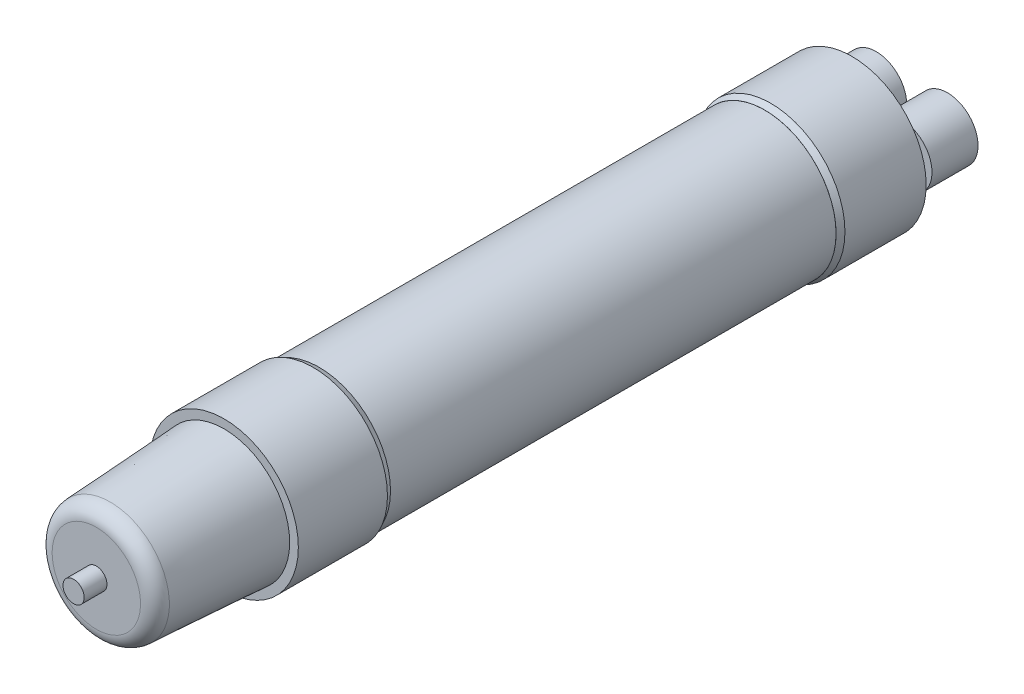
ISO-10303-21;
HEADER;
FILE_DESCRIPTION(('STEP AP214'),'2;1');
FILE_NAME('part.step','',(''),(''),'','','');
FILE_SCHEMA(('AUTOMOTIVE_DESIGN { 1 0 10303 214 1 1 1 1 }'));
ENDSEC;
DATA;
#1=APPLICATION_CONTEXT('core data for automotive mechanical design processes');
#2=APPLICATION_PROTOCOL_DEFINITION('international standard','automotive_design',2000,#1);
#3=PRODUCT_CONTEXT('',#1,'mechanical');
#4=PRODUCT('Part','Part','',(#3));
#5=PRODUCT_RELATED_PRODUCT_CATEGORY('part','',(#4));
#6=PRODUCT_DEFINITION_FORMATION('','',#4);
#7=PRODUCT_DEFINITION_CONTEXT('part definition',#1,'design');
#8=PRODUCT_DEFINITION('design','',#6,#7);
#9=PRODUCT_DEFINITION_SHAPE('','',#8);
#10=(LENGTH_UNIT() NAMED_UNIT(*) SI_UNIT(.MILLI.,.METRE.));
#11=(NAMED_UNIT(*) PLANE_ANGLE_UNIT() SI_UNIT($,.RADIAN.));
#12=(NAMED_UNIT(*) SI_UNIT($,.STERADIAN.) SOLID_ANGLE_UNIT());
#13=UNCERTAINTY_MEASURE_WITH_UNIT(LENGTH_MEASURE(1.E-05),#10,'distance_accuracy_value','');
#14=(GEOMETRIC_REPRESENTATION_CONTEXT(3) GLOBAL_UNCERTAINTY_ASSIGNED_CONTEXT((#13)) GLOBAL_UNIT_ASSIGNED_CONTEXT((#10,
#11,#12)) REPRESENTATION_CONTEXT('',''));
#15=CARTESIAN_POINT('',(0.,0.,0.));
#16=DIRECTION('',(0.,0.,1.));
#17=DIRECTION('',(1.,0.,0.));
#18=AXIS2_PLACEMENT_3D('',#15,#16,#17);
#19=CARTESIAN_POINT('',(0.,0.,0.));
#20=DIRECTION('',(0.,0.,1.));
#21=DIRECTION('',(1.,0.,0.));
#22=AXIS2_PLACEMENT_3D('',#19,#20,#21);
#23=PLANE('',#22);
#24=CARTESIAN_POINT('',(-15.24,0.,0.));
#25=DIRECTION('',(0.,0.,-1.));
#26=DIRECTION('',(1.,0.,0.));
#27=AXIS2_PLACEMENT_3D('',#24,#25,#26);
#28=CIRCLE('',#27,13.081);
#29=CARTESIAN_POINT('',(-13.9123208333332,13.013448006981,0.));
#30=VERTEX_POINT('',#29);
#31=CARTESIAN_POINT('',(-13.9123208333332,-13.013448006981,0.));
#32=VERTEX_POINT('',#31);
#33=EDGE_CURVE('E70',#30,#32,#28,.T.);
#34=ORIENTED_EDGE('',*,*,#33,.F.);
#35=CARTESIAN_POINT('',(0.,0.,0.));
#36=DIRECTION('',(0.,0.,1.));
#37=DIRECTION('',(1.,0.,0.));
#38=AXIS2_PLACEMENT_3D('',#35,#36,#37);
#39=CIRCLE('',#38,19.0499999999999);
#40=CARTESIAN_POINT('',(13.9123208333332,13.0134480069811,0.));
#41=VERTEX_POINT('',#40);
#42=EDGE_CURVE('E61',#30,#41,#39,.F.);
#43=ORIENTED_EDGE('',*,*,#42,.T.);
#44=CARTESIAN_POINT('',(15.24,0.,0.));
#45=DIRECTION('',(0.,0.,-1.));
#46=DIRECTION('',(-1.,0.,0.));
#47=AXIS2_PLACEMENT_3D('',#44,#45,#46);
#48=CIRCLE('',#47,13.081);
#49=CARTESIAN_POINT('',(13.9123208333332,-13.013448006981,0.));
#50=VERTEX_POINT('',#49);
#51=EDGE_CURVE('E11',#50,#41,#48,.T.);
#52=ORIENTED_EDGE('',*,*,#51,.F.);
#53=EDGE_CURVE('E68',#50,#32,#39,.F.);
#54=ORIENTED_EDGE('',*,*,#53,.T.);
#55=EDGE_LOOP('',(#34,#43,#52,#54));
#56=FACE_BOUND('',#55,.T.);
#57=ADVANCED_FACE('F34',(#56),#23,.F.);
#58=CARTESIAN_POINT('',(-18.8976802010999,0.,328.93));
#59=DIRECTION('',(0.,0.,1.));
#60=DIRECTION('',(1.,0.,0.));
#61=AXIS2_PLACEMENT_3D('',#58,#59,#60);
#62=PLANE('',#61);
#63=CARTESIAN_POINT('',(0.,0.,328.93));
#64=DIRECTION('',(0.,0.,-1.));
#65=DIRECTION('',(-1.,0.,0.));
#66=AXIS2_PLACEMENT_3D('',#63,#64,#65);
#67=CIRCLE('',#66,18.8976802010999);
#68=CARTESIAN_POINT('',(-18.8976802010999,0.,328.93));
#69=VERTEX_POINT('',#68);
#70=EDGE_CURVE('E93',#69,#69,#67,.T.);
#71=ORIENTED_EDGE('',*,*,#70,.F.);
#72=EDGE_LOOP('',(#71));
#73=FACE_BOUND('',#72,.T.);
#74=CARTESIAN_POINT('',(0.,0.,328.93));
#75=DIRECTION('',(0.,0.,1.));
#76=DIRECTION('',(1.,0.,0.));
#77=AXIS2_PLACEMENT_3D('',#74,#75,#76);
#78=CIRCLE('',#77,4.5339);
#79=CARTESIAN_POINT('',(4.5339,0.,328.93));
#80=VERTEX_POINT('',#79);
#81=EDGE_CURVE('E87',#80,#80,#78,.T.);
#82=ORIENTED_EDGE('',*,*,#81,.F.);
#83=EDGE_LOOP('',(#82));
#84=FACE_BOUND('',#83,.T.);
#85=ADVANCED_FACE('F145',(#73,#84),#62,.T.);
#86=CARTESIAN_POINT('',(0.,0.,43.18));
#87=DIRECTION('',(0.,0.,1.));
#88=DIRECTION('',(1.,0.,0.));
#89=AXIS2_PLACEMENT_3D('',#86,#87,#88);
#90=PLANE('',#89);
#91=CARTESIAN_POINT('',(0.,0.,43.18));
#92=DIRECTION('',(0.,0.,1.));
#93=DIRECTION('',(1.,0.,0.));
#94=AXIS2_PLACEMENT_3D('',#91,#92,#93);
#95=CIRCLE('',#94,30.5111592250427);
#96=CARTESIAN_POINT('',(30.5111592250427,0.,43.18));
#97=VERTEX_POINT('',#96);
#98=EDGE_CURVE('E114',#97,#97,#95,.T.);
#99=ORIENTED_EDGE('',*,*,#98,.T.);
#100=EDGE_LOOP('',(#99));
#101=FACE_BOUND('',#100,.T.);
#102=CARTESIAN_POINT('',(0.,0.,43.18));
#103=DIRECTION('',(0.,0.,1.));
#104=DIRECTION('',(1.,0.,0.));
#105=AXIS2_PLACEMENT_3D('',#102,#103,#104);
#106=CIRCLE('',#105,30.48);
#107=CARTESIAN_POINT('',(30.48,0.,43.18));
#108=VERTEX_POINT('',#107);
#109=EDGE_CURVE('E102',#108,#108,#106,.T.);
#110=ORIENTED_EDGE('',*,*,#109,.F.);
#111=EDGE_LOOP('',(#110));
#112=FACE_BOUND('',#111,.T.);
#113=ADVANCED_FACE('F150',(#101,#112),#90,.T.);
#114=CARTESIAN_POINT('',(0.,0.,43.18));
#115=DIRECTION('',(0.,0.,-1.));
#116=DIRECTION('',(-1.,0.,0.));
#117=AXIS2_PLACEMENT_3D('',#114,#115,#116);
#118=CYLINDRICAL_SURFACE('',#117,31.75);
#119=CARTESIAN_POINT('',(0.,0.,40.64));
#120=DIRECTION('',(0.,0.,1.));
#121=DIRECTION('',(1.,0.,0.));
#122=AXIS2_PLACEMENT_3D('',#119,#120,#121);
#123=CIRCLE('',#122,31.75);
#124=CARTESIAN_POINT('',(31.75,0.,40.64));
#125=VERTEX_POINT('',#124);
#126=EDGE_CURVE('E117',#125,#125,#123,.F.);
#127=ORIENTED_EDGE('',*,*,#126,.T.);
#128=EDGE_LOOP('',(#127));
#129=FACE_BOUND('',#128,.T.);
#130=CARTESIAN_POINT('',(0.,0.,5.92210725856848));
#131=DIRECTION('',(0.,0.,1.));
#132=DIRECTION('',(1.,0.,0.));
#133=AXIS2_PLACEMENT_3D('',#130,#131,#132);
#134=CIRCLE('',#133,31.75);
#135=CARTESIAN_POINT('',(31.75,0.,5.92210725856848));
#136=VERTEX_POINT('',#135);
#137=EDGE_CURVE('E111',#136,#136,#134,.T.);
#138=ORIENTED_EDGE('',*,*,#137,.T.);
#139=EDGE_LOOP('',(#138));
#140=FACE_BOUND('',#139,.T.);
#141=ADVANCED_FACE('F36',(#129,#140),#118,.T.);
#142=CARTESIAN_POINT('',(0.,0.,233.68));
#143=DIRECTION('',(0.,0.,-1.));
#144=DIRECTION('',(-1.,0.,0.));
#145=AXIS2_PLACEMENT_3D('',#142,#143,#144);
#146=CYLINDRICAL_SURFACE('',#145,30.48);
#147=CARTESIAN_POINT('',(0.,0.,233.68));
#148=DIRECTION('',(0.,0.,1.));
#149=DIRECTION('',(1.,0.,0.));
#150=AXIS2_PLACEMENT_3D('',#147,#148,#149);
#151=CIRCLE('',#150,30.48);
#152=CARTESIAN_POINT('',(30.48,0.,233.68));
#153=VERTEX_POINT('',#152);
#154=EDGE_CURVE('E105',#153,#153,#151,.T.);
#155=ORIENTED_EDGE('',*,*,#154,.F.);
#156=EDGE_LOOP('',(#155));
#157=FACE_BOUND('',#156,.T.);
#158=ORIENTED_EDGE('',*,*,#109,.T.);
#159=EDGE_LOOP('',(#158));
#160=FACE_BOUND('',#159,.T.);
#161=ADVANCED_FACE('F154',(#157,#160),#146,.T.);
#162=CARTESIAN_POINT('',(0.,0.,233.68));
#163=DIRECTION('',(0.,0.,1.));
#164=DIRECTION('',(1.,0.,0.));
#165=AXIS2_PLACEMENT_3D('',#162,#163,#164);
#166=PLANE('',#165);
#167=CARTESIAN_POINT('',(0.,0.,233.68));
#168=DIRECTION('',(0.,0.,1.));
#169=DIRECTION('',(1.,0.,0.));
#170=AXIS2_PLACEMENT_3D('',#167,#168,#169);
#171=CIRCLE('',#170,30.5111592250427);
#172=CARTESIAN_POINT('',(30.5111592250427,0.,233.68));
#173=VERTEX_POINT('',#172);
#174=EDGE_CURVE('E38',#173,#173,#171,.F.);
#175=ORIENTED_EDGE('',*,*,#174,.T.);
#176=EDGE_LOOP('',(#175));
#177=FACE_BOUND('',#176,.T.);
#178=ORIENTED_EDGE('',*,*,#154,.T.);
#179=EDGE_LOOP('',(#178));
#180=FACE_BOUND('',#179,.T.);
#181=ADVANCED_FACE('F126',(#177,#180),#166,.F.);
#182=CARTESIAN_POINT('',(0.,0.,274.32));
#183=DIRECTION('',(0.,0.,-1.));
#184=DIRECTION('',(-1.,0.,0.));
#185=AXIS2_PLACEMENT_3D('',#182,#183,#184);
#186=CYLINDRICAL_SURFACE('',#185,31.75);
#187=CARTESIAN_POINT('',(0.,0.,236.22));
#188=DIRECTION('',(0.,0.,1.));
#189=DIRECTION('',(1.,0.,0.));
#190=AXIS2_PLACEMENT_3D('',#187,#188,#189);
#191=CIRCLE('',#190,31.75);
#192=CARTESIAN_POINT('',(31.75,0.,236.22));
#193=VERTEX_POINT('',#192);
#194=EDGE_CURVE('E119',#193,#193,#191,.T.);
#195=ORIENTED_EDGE('',*,*,#194,.T.);
#196=EDGE_LOOP('',(#195));
#197=FACE_BOUND('',#196,.T.);
#198=CARTESIAN_POINT('',(0.,0.,274.32));
#199=DIRECTION('',(0.,0.,1.));
#200=DIRECTION('',(1.,0.,0.));
#201=AXIS2_PLACEMENT_3D('',#198,#199,#200);
#202=CIRCLE('',#201,31.75);
#203=CARTESIAN_POINT('',(31.75,0.,274.32));
#204=VERTEX_POINT('',#203);
#205=EDGE_CURVE('E99',#204,#204,#202,.T.);
#206=ORIENTED_EDGE('',*,*,#205,.F.);
#207=EDGE_LOOP('',(#206));
#208=FACE_BOUND('',#207,.T.);
#209=ADVANCED_FACE('F171',(#197,#208),#186,.T.);
#210=CARTESIAN_POINT('',(0.,0.,274.32));
#211=DIRECTION('',(0.,0.,1.));
#212=DIRECTION('',(1.,0.,0.));
#213=AXIS2_PLACEMENT_3D('',#210,#211,#212);
#214=PLANE('',#213);
#215=CARTESIAN_POINT('',(0.,0.,274.32));
#216=DIRECTION('',(0.,0.,1.));
#217=DIRECTION('',(1.,0.,0.));
#218=AXIS2_PLACEMENT_3D('',#215,#216,#217);
#219=CIRCLE('',#218,28.0416);
#220=CARTESIAN_POINT('',(28.0416,0.,274.32));
#221=VERTEX_POINT('',#220);
#222=EDGE_CURVE('E108',#221,#221,#219,.T.);
#223=ORIENTED_EDGE('',*,*,#222,.F.);
#224=EDGE_LOOP('',(#223));
#225=FACE_BOUND('',#224,.T.);
#226=ORIENTED_EDGE('',*,*,#205,.T.);
#227=EDGE_LOOP('',(#226));
#228=FACE_BOUND('',#227,.T.);
#229=ADVANCED_FACE('F177',(#225,#228),#214,.T.);
#230=CARTESIAN_POINT('',(0.,0.,274.32));
#231=DIRECTION('',(0.,0.,-1.));
#232=DIRECTION('',(-1.,0.,0.));
#233=AXIS2_PLACEMENT_3D('',#230,#231,#232);
#234=CONICAL_SURFACE('',#233,28.0416,0.0576105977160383);
#235=CARTESIAN_POINT('',(0.,0.,322.945624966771));
#236=DIRECTION('',(0.,0.,-1.));
#237=DIRECTION('',(-1.,0.,0.));
#238=AXIS2_PLACEMENT_3D('',#235,#236,#237);
#239=CIRCLE('',#238,25.2371453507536);
#240=CARTESIAN_POINT('',(-25.2371453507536,0.,322.945624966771));
#241=VERTEX_POINT('',#240);
#242=EDGE_CURVE('E96',#241,#241,#239,.T.);
#243=ORIENTED_EDGE('',*,*,#242,.T.);
#244=EDGE_LOOP('',(#243));
#245=FACE_BOUND('',#244,.T.);
#246=ORIENTED_EDGE('',*,*,#222,.T.);
#247=EDGE_LOOP('',(#246));
#248=FACE_BOUND('',#247,.T.);
#249=ADVANCED_FACE('F180',(#245,#248),#234,.T.);
#250=CARTESIAN_POINT('',(0.,0.,322.58));
#251=DIRECTION('',(0.,0.,-1.));
#252=DIRECTION('',(-1.,0.,0.));
#253=AXIS2_PLACEMENT_3D('',#250,#251,#252);
#254=TOROIDAL_SURFACE('',#253,18.8976802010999,6.35000000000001);
#255=ORIENTED_EDGE('',*,*,#70,.T.);
#256=EDGE_LOOP('',(#255));
#257=FACE_BOUND('',#256,.T.);
#258=ORIENTED_EDGE('',*,*,#242,.F.);
#259=EDGE_LOOP('',(#258));
#260=FACE_BOUND('',#259,.T.);
#261=ADVANCED_FACE('F187',(#257,#260),#254,.T.);
#262=CARTESIAN_POINT('',(0.,0.,5.92210725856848));
#263=DIRECTION('',(0.,0.,1.));
#264=DIRECTION('',(1.,0.,0.));
#265=AXIS2_PLACEMENT_3D('',#262,#263,#264);
#266=CONICAL_SURFACE('',#265,31.75,1.13446401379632);
#267=ORIENTED_EDGE('',*,*,#53,.F.);
#268=EDGE_CURVE('E66',#41,#50,#39,.F.);
#269=ORIENTED_EDGE('',*,*,#268,.F.);
#270=ORIENTED_EDGE('',*,*,#42,.F.);
#271=EDGE_CURVE('E51',#32,#30,#39,.F.);
#272=ORIENTED_EDGE('',*,*,#271,.F.);
#273=EDGE_LOOP('',(#267,#269,#270,#272));
#274=FACE_BOUND('',#273,.T.);
#275=ORIENTED_EDGE('',*,*,#137,.F.);
#276=EDGE_LOOP('',(#275));
#277=FACE_BOUND('',#276,.T.);
#278=ADVANCED_FACE('F63',(#274,#277),#266,.T.);
#279=CARTESIAN_POINT('',(0.,0.,43.18));
#280=DIRECTION('',(0.,0.,-1.));
#281=DIRECTION('',(-1.,0.,0.));
#282=AXIS2_PLACEMENT_3D('',#279,#280,#281);
#283=CONICAL_SURFACE('',#282,30.5111592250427,0.453785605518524);
#284=ORIENTED_EDGE('',*,*,#126,.F.);
#285=EDGE_LOOP('',(#284));
#286=FACE_BOUND('',#285,.T.);
#287=ORIENTED_EDGE('',*,*,#98,.F.);
#288=EDGE_LOOP('',(#287));
#289=FACE_BOUND('',#288,.T.);
#290=ADVANCED_FACE('F133',(#286,#289),#283,.T.);
#291=CARTESIAN_POINT('',(0.,0.,236.22));
#292=DIRECTION('',(0.,0.,1.));
#293=DIRECTION('',(1.,0.,0.));
#294=AXIS2_PLACEMENT_3D('',#291,#292,#293);
#295=CONICAL_SURFACE('',#294,31.75,0.453785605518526);
#296=ORIENTED_EDGE('',*,*,#174,.F.);
#297=EDGE_LOOP('',(#296));
#298=FACE_BOUND('',#297,.T.);
#299=ORIENTED_EDGE('',*,*,#194,.F.);
#300=EDGE_LOOP('',(#299));
#301=FACE_BOUND('',#300,.T.);
#302=ADVANCED_FACE('F129',(#298,#301),#295,.T.);
#303=CARTESIAN_POINT('',(0.,0.,338.6582));
#304=DIRECTION('',(0.,0.,-1.));
#305=DIRECTION('',(-1.,0.,0.));
#306=AXIS2_PLACEMENT_3D('',#303,#304,#305);
#307=CYLINDRICAL_SURFACE('',#306,4.5339);
#308=CARTESIAN_POINT('',(0.,0.,338.6582));
#309=DIRECTION('',(0.,0.,1.));
#310=DIRECTION('',(1.,0.,0.));
#311=AXIS2_PLACEMENT_3D('',#308,#309,#310);
#312=CIRCLE('',#311,4.5339);
#313=CARTESIAN_POINT('',(4.5339,0.,338.6582));
#314=VERTEX_POINT('',#313);
#315=EDGE_CURVE('E90',#314,#314,#312,.T.);
#316=ORIENTED_EDGE('',*,*,#315,.F.);
#317=EDGE_LOOP('',(#316));
#318=FACE_BOUND('',#317,.T.);
#319=ORIENTED_EDGE('',*,*,#81,.T.);
#320=EDGE_LOOP('',(#319));
#321=FACE_BOUND('',#320,.T.);
#322=ADVANCED_FACE('F132',(#318,#321),#307,.T.);
#323=CARTESIAN_POINT('',(0.,0.,338.6582));
#324=DIRECTION('',(0.,0.,1.));
#325=DIRECTION('',(1.,0.,0.));
#326=AXIS2_PLACEMENT_3D('',#323,#324,#325);
#327=PLANE('',#326);
#328=ORIENTED_EDGE('',*,*,#315,.T.);
#329=EDGE_LOOP('',(#328));
#330=FACE_BOUND('',#329,.T.);
#331=ADVANCED_FACE('F139',(#330),#327,.T.);
#332=CARTESIAN_POINT('',(15.24,0.,0.));
#333=DIRECTION('',(0.,0.,-1.));
#334=DIRECTION('',(-1.,0.,0.));
#335=AXIS2_PLACEMENT_3D('',#332,#333,#334);
#336=PLANE('',#335);
#337=EDGE_CURVE('E44',#41,#50,#48,.T.);
#338=ORIENTED_EDGE('',*,*,#337,.F.);
#339=ORIENTED_EDGE('',*,*,#268,.T.);
#340=EDGE_LOOP('',(#338,#339));
#341=FACE_BOUND('',#340,.T.);
#342=ADVANCED_FACE('F254',(#341),#336,.F.);
#343=CARTESIAN_POINT('',(15.24,0.,-19.685));
#344=DIRECTION('',(0.,0.,1.));
#345=DIRECTION('',(1.,0.,0.));
#346=AXIS2_PLACEMENT_3D('',#343,#344,#345);
#347=CYLINDRICAL_SURFACE('',#346,13.081);
#348=CARTESIAN_POINT('',(15.24,0.,-19.685));
#349=DIRECTION('',(0.,0.,-1.));
#350=DIRECTION('',(-1.,0.,0.));
#351=AXIS2_PLACEMENT_3D('',#348,#349,#350);
#352=CIRCLE('',#351,13.081);
#353=CARTESIAN_POINT('',(2.15899999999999,0.,-19.685));
#354=VERTEX_POINT('',#353);
#355=EDGE_CURVE('E84',#354,#354,#352,.T.);
#356=ORIENTED_EDGE('',*,*,#355,.F.);
#357=EDGE_LOOP('',(#356));
#358=FACE_BOUND('',#357,.T.);
#359=ORIENTED_EDGE('',*,*,#337,.T.);
#360=ORIENTED_EDGE('',*,*,#51,.T.);
#361=EDGE_LOOP('',(#359,#360));
#362=FACE_BOUND('',#361,.T.);
#363=ADVANCED_FACE('F269',(#358,#362),#347,.T.);
#364=CARTESIAN_POINT('',(15.24,0.,-19.685));
#365=DIRECTION('',(0.,0.,-1.));
#366=DIRECTION('',(-1.,0.,0.));
#367=AXIS2_PLACEMENT_3D('',#364,#365,#366);
#368=PLANE('',#367);
#369=ORIENTED_EDGE('',*,*,#355,.T.);
#370=EDGE_LOOP('',(#369));
#371=FACE_BOUND('',#370,.T.);
#372=ADVANCED_FACE('F278',(#371),#368,.T.);
#373=CARTESIAN_POINT('',(-15.24,0.,-19.685));
#374=DIRECTION('',(0.,0.,1.));
#375=DIRECTION('',(1.,0.,0.));
#376=AXIS2_PLACEMENT_3D('',#373,#374,#375);
#377=CYLINDRICAL_SURFACE('',#376,13.081);
#378=CARTESIAN_POINT('',(-15.24,0.,-19.685));
#379=DIRECTION('',(0.,0.,-1.));
#380=DIRECTION('',(1.,0.,0.));
#381=AXIS2_PLACEMENT_3D('',#378,#379,#380);
#382=CIRCLE('',#381,13.081);
#383=CARTESIAN_POINT('',(-2.15899999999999,0.,-19.685));
#384=VERTEX_POINT('',#383);
#385=EDGE_CURVE('E79',#384,#384,#382,.T.);
#386=ORIENTED_EDGE('',*,*,#385,.F.);
#387=EDGE_LOOP('',(#386));
#388=FACE_BOUND('',#387,.T.);
#389=EDGE_CURVE('E74',#32,#30,#28,.T.);
#390=ORIENTED_EDGE('',*,*,#389,.T.);
#391=ORIENTED_EDGE('',*,*,#33,.T.);
#392=EDGE_LOOP('',(#390,#391));
#393=FACE_BOUND('',#392,.T.);
#394=ADVANCED_FACE('F78',(#388,#393),#377,.T.);
#395=CARTESIAN_POINT('',(-15.24,0.,-19.685));
#396=DIRECTION('',(0.,0.,1.));
#397=DIRECTION('',(1.,0.,0.));
#398=AXIS2_PLACEMENT_3D('',#395,#396,#397);
#399=PLANE('',#398);
#400=ORIENTED_EDGE('',*,*,#385,.T.);
#401=EDGE_LOOP('',(#400));
#402=FACE_BOUND('',#401,.T.);
#403=ADVANCED_FACE('F295',(#402),#399,.F.);
#404=CARTESIAN_POINT('',(-15.24,0.,0.));
#405=DIRECTION('',(0.,0.,1.));
#406=DIRECTION('',(1.,0.,0.));
#407=AXIS2_PLACEMENT_3D('',#404,#405,#406);
#408=PLANE('',#407);
#409=ORIENTED_EDGE('',*,*,#389,.F.);
#410=ORIENTED_EDGE('',*,*,#271,.T.);
#411=EDGE_LOOP('',(#409,#410));
#412=FACE_BOUND('',#411,.T.);
#413=ADVANCED_FACE('F77',(#412),#408,.T.);
#414=CLOSED_SHELL('',(#57,#85,#113,#141,#161,#181,#209,#229,#249,#261,#278,#290,#302,#322,#331,
#342,#363,#372,#394,#403,#413));
#415=MANIFOLD_SOLID_BREP('B2',#414);
#416=ADVANCED_BREP_SHAPE_REPRESENTATION('',(#18,#415),#14);
#417=SHAPE_DEFINITION_REPRESENTATION(#9,#416);
ENDSEC;
END-ISO-10303-21;
